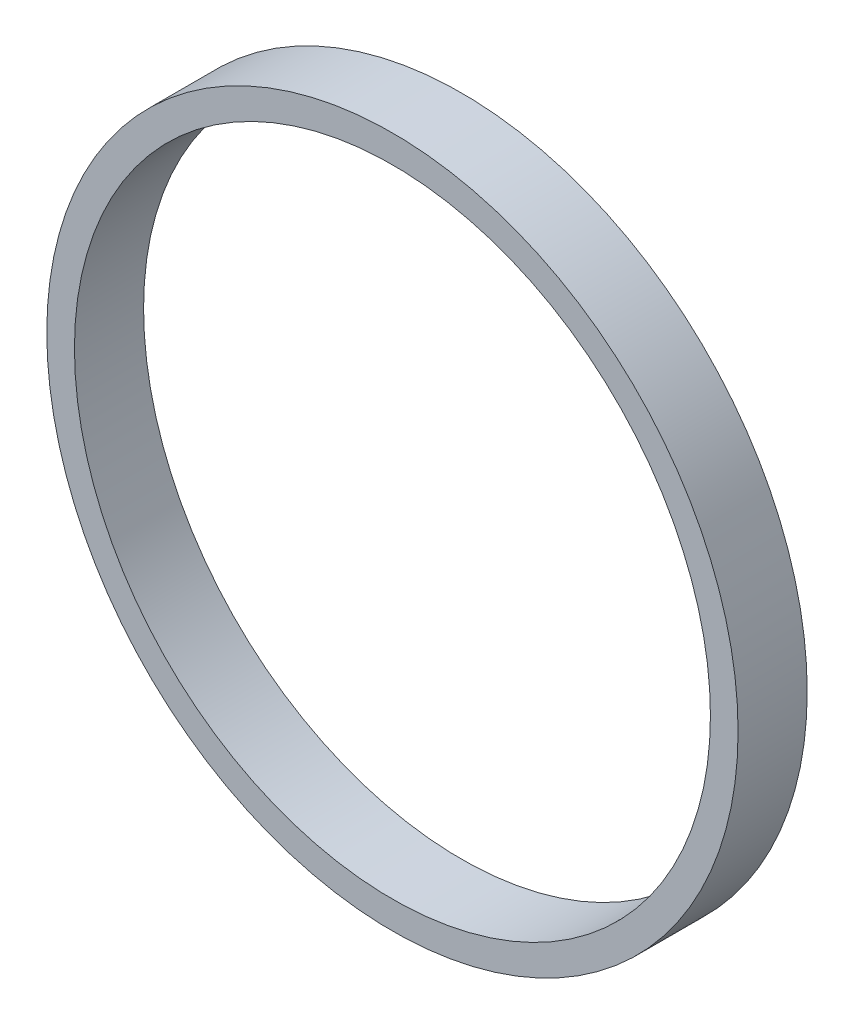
from build123d import *

# Parameters (mm, degrees)
SKETCH1_R           = 25
SKETCH1_R_2         = 23
BOSS_EXTRUDE1_DEPTH = 5


with BuildPart() as part:
    # Sketch1 → Boss-Extrude1 (new body)
    with BuildSketch(Plane.XY):
        Circle(SKETCH1_R)
        Circle(SKETCH1_R_2, mode=Mode.SUBTRACT)
    extrude(amount=BOSS_EXTRUDE1_DEPTH)


solid = part.part
